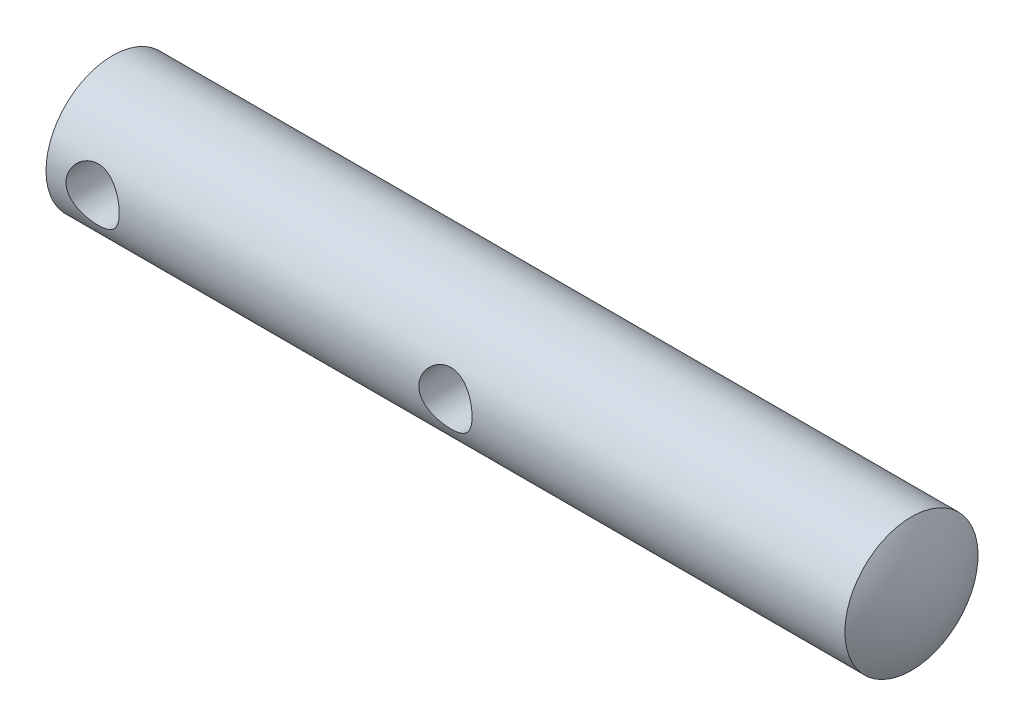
ISO-10303-21;
HEADER;
FILE_DESCRIPTION(('STEP AP214'),'2;1');
FILE_NAME('part.step','',(''),(''),'','','');
FILE_SCHEMA(('AUTOMOTIVE_DESIGN { 1 0 10303 214 1 1 1 1 }'));
ENDSEC;
DATA;
#1=APPLICATION_CONTEXT('core data for automotive mechanical design processes');
#2=APPLICATION_PROTOCOL_DEFINITION('international standard','automotive_design',2000,#1);
#3=PRODUCT_CONTEXT('',#1,'mechanical');
#4=PRODUCT('Part','Part','',(#3));
#5=PRODUCT_RELATED_PRODUCT_CATEGORY('part','',(#4));
#6=PRODUCT_DEFINITION_FORMATION('','',#4);
#7=PRODUCT_DEFINITION_CONTEXT('part definition',#1,'design');
#8=PRODUCT_DEFINITION('design','',#6,#7);
#9=PRODUCT_DEFINITION_SHAPE('','',#8);
#10=(LENGTH_UNIT() NAMED_UNIT(*) SI_UNIT(.MILLI.,.METRE.));
#11=(NAMED_UNIT(*) PLANE_ANGLE_UNIT() SI_UNIT($,.RADIAN.));
#12=(NAMED_UNIT(*) SI_UNIT($,.STERADIAN.) SOLID_ANGLE_UNIT());
#13=UNCERTAINTY_MEASURE_WITH_UNIT(LENGTH_MEASURE(1.E-05),#10,'distance_accuracy_value','');
#14=(GEOMETRIC_REPRESENTATION_CONTEXT(3) GLOBAL_UNCERTAINTY_ASSIGNED_CONTEXT((#13)) GLOBAL_UNIT_ASSIGNED_CONTEXT((#10,
#11,#12)) REPRESENTATION_CONTEXT('',''));
#15=CARTESIAN_POINT('',(0.,0.,0.));
#16=DIRECTION('',(0.,0.,1.));
#17=DIRECTION('',(1.,0.,0.));
#18=AXIS2_PLACEMENT_3D('',#15,#16,#17);
#19=CARTESIAN_POINT('',(4.86154146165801,0.,5.));
#20=DIRECTION('',(0.,0.,1.));
#21=DIRECTION('',(1.,0.,0.));
#22=AXIS2_PLACEMENT_3D('',#19,#20,#21);
#23=CYLINDRICAL_SURFACE('',#22,2.);
#24=CARTESIAN_POINT('',(6.861541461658,0.,5.));
#25=CARTESIAN_POINT('',(6.86153160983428,0.10749300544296,4.99999271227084));
#26=CARTESIAN_POINT('',(6.85282370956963,0.215172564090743,4.99649294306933));
#27=CARTESIAN_POINT('',(6.81829375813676,0.427496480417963,4.98283453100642));
#28=CARTESIAN_POINT('',(6.79242518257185,0.532131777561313,4.97265778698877));
#29=CARTESIAN_POINT('',(6.72466538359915,0.734953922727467,4.94674209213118));
#30=CARTESIAN_POINT('',(6.68282661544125,0.833160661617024,4.93102136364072));
#31=CARTESIAN_POINT('',(6.58452228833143,1.02107197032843,4.89556610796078));
#32=CARTESIAN_POINT('',(6.52806180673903,1.11077947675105,4.87583297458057));
#33=CARTESIAN_POINT('',(6.39930596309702,1.28350100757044,4.83330886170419));
#34=CARTESIAN_POINT('',(6.3264348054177,1.36606227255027,4.81042296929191));
#35=CARTESIAN_POINT('',(6.16814145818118,1.51817500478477,4.76460576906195));
#36=CARTESIAN_POINT('',(6.0827131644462,1.58772010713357,4.74167444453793));
#37=CARTESIAN_POINT('',(5.89711339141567,1.71487456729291,4.69722791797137));
#38=CARTESIAN_POINT('',(5.79645497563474,1.77181498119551,4.67582115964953));
#39=CARTESIAN_POINT('',(5.5860050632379,1.86775471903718,4.63833647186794));
#40=CARTESIAN_POINT('',(5.47621793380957,1.90676256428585,4.62225601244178));
#41=CARTESIAN_POINT('',(5.25582912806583,1.96389882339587,4.59826357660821));
#42=CARTESIAN_POINT('',(5.14549022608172,1.98289396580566,4.59001420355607));
#43=CARTESIAN_POINT('',(4.92290646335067,2.00217296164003,4.58164004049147));
#44=CARTESIAN_POINT('',(4.81066256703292,2.00246601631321,4.58151125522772));
#45=CARTESIAN_POINT('',(4.5957847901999,1.98498936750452,4.58910500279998));
#46=CARTESIAN_POINT('',(4.49302574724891,1.96847531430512,4.59628175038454));
#47=CARTESIAN_POINT('',(4.29188190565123,1.9199468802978,4.6167618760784));
#48=CARTESIAN_POINT('',(4.19349787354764,1.8879297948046,4.63006632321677));
#49=CARTESIAN_POINT('',(4.00152362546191,1.80869473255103,4.66159485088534));
#50=CARTESIAN_POINT('',(3.90807222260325,1.76117986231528,4.67991379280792));
#51=CARTESIAN_POINT('',(3.73012564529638,1.65250646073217,4.71938116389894));
#52=CARTESIAN_POINT('',(3.64563385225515,1.59134280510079,4.74053065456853));
#53=CARTESIAN_POINT('',(3.48113173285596,1.45155059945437,4.78526736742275));
#54=CARTESIAN_POINT('',(3.40197273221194,1.37193746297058,4.80891664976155));
#55=CARTESIAN_POINT('',(3.25785698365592,1.20031442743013,4.85459824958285));
#56=CARTESIAN_POINT('',(3.19290306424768,1.10830206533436,4.87663024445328));
#57=CARTESIAN_POINT('',(3.07792401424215,0.912077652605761,4.91714681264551));
#58=CARTESIAN_POINT('',(3.02821918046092,0.8076604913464,4.93555270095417));
#59=CARTESIAN_POINT('',(2.94737360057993,0.591023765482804,4.96614828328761));
#60=CARTESIAN_POINT('',(2.91622342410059,0.478808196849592,4.97834113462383));
#61=CARTESIAN_POINT('',(2.87509316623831,0.256895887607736,4.99456139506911));
#62=CARTESIAN_POINT('',(2.86396900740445,0.147443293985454,4.99902945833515));
#63=CARTESIAN_POINT('',(2.8598283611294,-0.0718453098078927,5.00068478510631));
#64=CARTESIAN_POINT('',(2.86680718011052,-0.181681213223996,4.9978739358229));
#65=CARTESIAN_POINT('',(2.89783321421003,-0.393432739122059,4.98557567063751));
#66=CARTESIAN_POINT('',(2.921099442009,-0.495482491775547,4.97639391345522));
#67=CARTESIAN_POINT('',(2.98297716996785,-0.694135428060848,4.95259441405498));
#68=CARTESIAN_POINT('',(3.02159064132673,-0.790737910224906,4.93797597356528));
#69=CARTESIAN_POINT('',(3.11432640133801,-0.979078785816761,4.90416594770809));
#70=CARTESIAN_POINT('',(3.1688869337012,-1.07057802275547,4.88484815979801));
#71=CARTESIAN_POINT('',(3.2914817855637,-1.24344359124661,4.84373364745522));
#72=CARTESIAN_POINT('',(3.35952150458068,-1.32480584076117,4.82193593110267));
#73=CARTESIAN_POINT('',(3.5124114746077,-1.48072304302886,4.77645117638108));
#74=CARTESIAN_POINT('',(3.59807500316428,-1.55447393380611,4.75273441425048));
#75=CARTESIAN_POINT('',(3.78098154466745,-1.68675119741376,4.70741672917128));
#76=CARTESIAN_POINT('',(3.87822646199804,-1.74527506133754,4.68581615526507));
#77=CARTESIAN_POINT('',(4.0830031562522,-1.84580750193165,4.64714299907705));
#78=CARTESIAN_POINT('',(4.1906254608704,-1.88765059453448,4.63011630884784));
#79=CARTESIAN_POINT('',(4.41227511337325,-1.95229621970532,4.60323673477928));
#80=CARTESIAN_POINT('',(4.52629766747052,-1.97511280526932,4.59337855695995));
#81=CARTESIAN_POINT('',(4.74866936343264,-1.9997156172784,4.58271759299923));
#82=CARTESIAN_POINT('',(4.85683630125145,-2.00289708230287,4.58131421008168));
#83=CARTESIAN_POINT('',(5.07208631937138,-1.99180315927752,4.58614836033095));
#84=CARTESIAN_POINT('',(5.17916953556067,-1.97752998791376,4.59238492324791));
#85=CARTESIAN_POINT('',(5.38487365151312,-1.93307136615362,4.61126649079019));
#86=CARTESIAN_POINT('',(5.48366173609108,-1.90353749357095,4.62364831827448));
#87=CARTESIAN_POINT('',(5.67492009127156,-1.83000544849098,4.65324001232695));
#88=CARTESIAN_POINT('',(5.7673886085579,-1.78600328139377,4.67045121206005));
#89=CARTESIAN_POINT('',(5.94915108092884,-1.68187276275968,4.7089860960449));
#90=CARTESIAN_POINT('',(6.03796013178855,-1.62096533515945,4.73048882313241));
#91=CARTESIAN_POINT('',(6.20453477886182,-1.48589211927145,4.77463804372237));
#92=CARTESIAN_POINT('',(6.28229703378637,-1.41172233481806,4.79728488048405));
#93=CARTESIAN_POINT('',(6.42974431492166,-1.2465055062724,4.84293567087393));
#94=CARTESIAN_POINT('',(6.49857876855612,-1.15467600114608,4.86586757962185));
#95=CARTESIAN_POINT('',(6.61987850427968,-0.959900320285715,4.90800406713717));
#96=CARTESIAN_POINT('',(6.67233617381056,-0.856949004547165,4.92720691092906));
#97=CARTESIAN_POINT('',(6.75816367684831,-0.644738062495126,4.95939714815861));
#98=CARTESIAN_POINT('',(6.79187078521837,-0.535631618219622,4.97249363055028));
#99=CARTESIAN_POINT('',(6.84018058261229,-0.312876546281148,4.99144306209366));
#100=CARTESIAN_POINT('',(6.8548438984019,-0.199243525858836,4.99731899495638));
#101=CARTESIAN_POINT('',(6.86093684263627,-0.0569122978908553,4.99975899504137));
#102=CARTESIAN_POINT('',(6.8615440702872,-0.0284626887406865,5.00000192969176));
#103=CARTESIAN_POINT('',(6.861541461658,0.,5.));
#104=B_SPLINE_CURVE_WITH_KNOTS('',3,(#24,#25,#26,#27,#28,#29,#30,#31,#32,#33,#34,#35,#36,#37,
#38,#39,#40,#41,#42,#43,#44,#45,#46,#47,#48,#49,#50,#51,#52,#53,#54,#55,#56,#57,#58,#59,#60,#61,
#62,#63,#64,#65,#66,#67,#68,#69,#70,#71,#72,#73,#74,#75,#76,#77,#78,#79,#80,#81,#82,#83,#84,#85,
#86,#87,#88,#89,#90,#91,#92,#93,#94,#95,#96,#97,#98,#99,#100,#101,#102,#103),.UNSPECIFIED.,.T.,
.F.,(4,2,2,2,2,2,2,2,2,2,2,2,2,2,2,2,2,2,2,2,2,2,2,2,2,2,2,2,2,2,2,2,2,2,2,2,2,2,2,4),(0.,
0.32240298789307,0.645683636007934,0.96791145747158,1.29002753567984,1.62597381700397,
1.96208394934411,2.31315258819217,2.66405423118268,2.99904105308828,3.33386306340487,
3.64538328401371,3.95695787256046,4.27489126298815,4.59294421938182,4.93558349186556,
5.27829092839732,5.62776913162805,5.97706956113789,6.30569184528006,6.6342289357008,
6.94800455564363,7.26182048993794,7.5852351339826,7.90877959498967,8.25368474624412,
8.59864669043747,8.94695045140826,9.29499672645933,9.61799673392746,9.94095572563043,
10.2511431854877,10.5614163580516,10.8894546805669,11.2175920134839,11.5670042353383,
11.9165786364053,12.2596430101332,12.6016125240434,12.6869804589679),.UNSPECIFIED.);
#105=CARTESIAN_POINT('',(6.861541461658,0.,5.));
#106=VERTEX_POINT('',#105);
#107=EDGE_CURVE('E32',#106,#106,#104,.T.);
#108=ORIENTED_EDGE('',*,*,#107,.T.);
#109=EDGE_LOOP('',(#108));
#110=FACE_BOUND('',#109,.T.);
#111=CARTESIAN_POINT('',(4.86154146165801,0.,0.));
#112=DIRECTION('',(0.,0.,-1.));
#113=DIRECTION('',(0.,1.,0.));
#114=AXIS2_PLACEMENT_3D('',#111,#112,#113);
#115=CIRCLE('',#114,2.);
#116=CARTESIAN_POINT('',(4.86154146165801,2.,0.));
#117=VERTEX_POINT('',#116);
#118=EDGE_CURVE('E8',#117,#117,#115,.F.);
#119=ORIENTED_EDGE('',*,*,#118,.F.);
#120=EDGE_LOOP('',(#119));
#121=FACE_BOUND('',#120,.T.);
#122=ADVANCED_FACE('F12',(#110,#121),#23,.F.);
#123=CARTESIAN_POINT('',(31.361541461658,0.,5.));
#124=DIRECTION('',(0.,0.,1.));
#125=DIRECTION('',(1.,0.,0.));
#126=AXIS2_PLACEMENT_3D('',#123,#124,#125);
#127=CYLINDRICAL_SURFACE('',#126,2.);
#128=CARTESIAN_POINT('',(33.361541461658,0.,5.));
#129=CARTESIAN_POINT('',(33.3615316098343,0.107493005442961,4.99999271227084));
#130=CARTESIAN_POINT('',(33.3528237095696,0.215172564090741,4.99649294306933));
#131=CARTESIAN_POINT('',(33.3182937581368,0.427496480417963,4.98283453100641));
#132=CARTESIAN_POINT('',(33.2924251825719,0.532131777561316,4.97265778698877));
#133=CARTESIAN_POINT('',(33.2246653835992,0.734953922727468,4.94674209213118));
#134=CARTESIAN_POINT('',(33.1828266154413,0.833160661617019,4.93102136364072));
#135=CARTESIAN_POINT('',(33.0845222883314,1.02107197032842,4.89556610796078));
#136=CARTESIAN_POINT('',(33.0280618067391,1.11077947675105,4.87583297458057));
#137=CARTESIAN_POINT('',(32.899305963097,1.28350100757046,4.83330886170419));
#138=CARTESIAN_POINT('',(32.8264348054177,1.36606227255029,4.81042296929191));
#139=CARTESIAN_POINT('',(32.6681414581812,1.51817500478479,4.76460576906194));
#140=CARTESIAN_POINT('',(32.5827131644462,1.58772010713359,4.74167444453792));
#141=CARTESIAN_POINT('',(32.3971133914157,1.71487456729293,4.69722791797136));
#142=CARTESIAN_POINT('',(32.2964549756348,1.77181498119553,4.67582115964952));
#143=CARTESIAN_POINT('',(32.086005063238,1.86775471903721,4.63833647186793));
#144=CARTESIAN_POINT('',(31.9762179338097,1.90676256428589,4.62225601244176));
#145=CARTESIAN_POINT('',(31.7558291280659,1.96389882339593,4.59826357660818));
#146=CARTESIAN_POINT('',(31.6454902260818,1.98289396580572,4.59001420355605));
#147=CARTESIAN_POINT('',(31.4229064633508,2.00217296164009,4.58164004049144));
#148=CARTESIAN_POINT('',(31.310662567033,2.00246601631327,4.58151125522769));
#149=CARTESIAN_POINT('',(31.0957847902,1.9849893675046,4.58910500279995));
#150=CARTESIAN_POINT('',(30.993025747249,1.96847531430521,4.5962817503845));
#151=CARTESIAN_POINT('',(30.7918819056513,1.91994688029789,4.61676187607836));
#152=CARTESIAN_POINT('',(30.6934978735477,1.88792979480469,4.63006632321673));
#153=CARTESIAN_POINT('',(30.501523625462,1.80869473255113,4.6615948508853));
#154=CARTESIAN_POINT('',(30.4080722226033,1.76117986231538,4.67991379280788));
#155=CARTESIAN_POINT('',(30.2301256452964,1.65250646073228,4.7193811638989));
#156=CARTESIAN_POINT('',(30.1456338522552,1.5913428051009,4.74053065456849));
#157=CARTESIAN_POINT('',(29.981131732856,1.4515505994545,4.78526736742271));
#158=CARTESIAN_POINT('',(29.901972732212,1.37193746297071,4.80891664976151));
#159=CARTESIAN_POINT('',(29.757856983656,1.20031442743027,4.85459824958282));
#160=CARTESIAN_POINT('',(29.6929030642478,1.10830206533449,4.87663024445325));
#161=CARTESIAN_POINT('',(29.5779240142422,0.912077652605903,4.91714681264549));
#162=CARTESIAN_POINT('',(29.528219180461,0.807660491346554,4.93555270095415));
#163=CARTESIAN_POINT('',(29.4473736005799,0.591023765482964,4.96614828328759));
#164=CARTESIAN_POINT('',(29.4162234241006,0.478808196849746,4.97834113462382));
#165=CARTESIAN_POINT('',(29.3750931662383,0.256895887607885,4.9945613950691));
#166=CARTESIAN_POINT('',(29.3639690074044,0.147443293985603,4.99902945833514));
#167=CARTESIAN_POINT('',(29.3598283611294,-0.0718453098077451,5.00068478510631));
#168=CARTESIAN_POINT('',(29.3668071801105,-0.181681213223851,4.99787393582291));
#169=CARTESIAN_POINT('',(29.39783321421,-0.39343273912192,4.98557567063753));
#170=CARTESIAN_POINT('',(29.421099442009,-0.495482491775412,4.97639391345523));
#171=CARTESIAN_POINT('',(29.4829771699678,-0.694135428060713,4.952594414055));
#172=CARTESIAN_POINT('',(29.5215906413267,-0.790737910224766,4.93797597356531));
#173=CARTESIAN_POINT('',(29.614326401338,-0.97907878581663,4.90416594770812));
#174=CARTESIAN_POINT('',(29.6688869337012,-1.07057802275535,4.88484815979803));
#175=CARTESIAN_POINT('',(29.7914817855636,-1.2434435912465,4.84373364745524));
#176=CARTESIAN_POINT('',(29.8595215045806,-1.32480584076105,4.82193593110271));
#177=CARTESIAN_POINT('',(30.0124114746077,-1.48072304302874,4.77645117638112));
#178=CARTESIAN_POINT('',(30.0980750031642,-1.55447393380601,4.75273441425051));
#179=CARTESIAN_POINT('',(30.2809815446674,-1.68675119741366,4.70741672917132));
#180=CARTESIAN_POINT('',(30.378226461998,-1.74527506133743,4.68581615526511));
#181=CARTESIAN_POINT('',(30.5830031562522,-1.84580750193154,4.64714299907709));
#182=CARTESIAN_POINT('',(30.6906254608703,-1.88765059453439,4.63011630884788));
#183=CARTESIAN_POINT('',(30.9122751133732,-1.95229621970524,4.60323673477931));
#184=CARTESIAN_POINT('',(31.0262976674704,-1.97511280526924,4.59337855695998));
#185=CARTESIAN_POINT('',(31.2486693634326,-1.99971561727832,4.58271759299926));
#186=CARTESIAN_POINT('',(31.3568363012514,-2.0028970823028,4.58131421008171));
#187=CARTESIAN_POINT('',(31.5720863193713,-1.99180315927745,4.58614836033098));
#188=CARTESIAN_POINT('',(31.6791695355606,-1.9775299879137,4.59238492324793));
#189=CARTESIAN_POINT('',(31.8848736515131,-1.93307136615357,4.61126649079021));
#190=CARTESIAN_POINT('',(31.983661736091,-1.9035374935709,4.62364831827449));
#191=CARTESIAN_POINT('',(32.1749200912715,-1.83000544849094,4.65324001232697));
#192=CARTESIAN_POINT('',(32.2673886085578,-1.78600328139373,4.67045121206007));
#193=CARTESIAN_POINT('',(32.4491510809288,-1.68187276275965,4.70898609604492));
#194=CARTESIAN_POINT('',(32.5379601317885,-1.62096533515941,4.73048882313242));
#195=CARTESIAN_POINT('',(32.7045347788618,-1.48589211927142,4.77463804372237));
#196=CARTESIAN_POINT('',(32.7822970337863,-1.41172233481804,4.79728488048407));
#197=CARTESIAN_POINT('',(32.9297443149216,-1.24650550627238,4.84293567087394));
#198=CARTESIAN_POINT('',(32.9985787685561,-1.15467600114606,4.86586757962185));
#199=CARTESIAN_POINT('',(33.1198785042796,-0.959900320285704,4.90800406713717));
#200=CARTESIAN_POINT('',(33.1723361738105,-0.85694900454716,4.92720691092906));
#201=CARTESIAN_POINT('',(33.2581636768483,-0.644738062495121,4.95939714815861));
#202=CARTESIAN_POINT('',(33.2918707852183,-0.535631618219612,4.97249363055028));
#203=CARTESIAN_POINT('',(33.3401805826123,-0.312876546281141,4.99144306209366));
#204=CARTESIAN_POINT('',(33.3548438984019,-0.199243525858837,4.99731899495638));
#205=CARTESIAN_POINT('',(33.3609368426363,-0.0569122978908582,4.99975899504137));
#206=CARTESIAN_POINT('',(33.3615440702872,-0.0284626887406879,5.00000192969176));
#207=CARTESIAN_POINT('',(33.361541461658,0.,5.));
#208=B_SPLINE_CURVE_WITH_KNOTS('',3,(#128,#129,#130,#131,#132,#133,#134,#135,#136,#137,#138,
#139,#140,#141,#142,#143,#144,#145,#146,#147,#148,#149,#150,#151,#152,#153,#154,#155,#156,#157,
#158,#159,#160,#161,#162,#163,#164,#165,#166,#167,#168,#169,#170,#171,#172,#173,#174,#175,#176,
#177,#178,#179,#180,#181,#182,#183,#184,#185,#186,#187,#188,#189,#190,#191,#192,#193,#194,#195,
#196,#197,#198,#199,#200,#201,#202,#203,#204,#205,#206,#207),.UNSPECIFIED.,.T.,.F.,(4,2,2,2,2,2,
2,2,2,2,2,2,2,2,2,2,2,2,2,2,2,2,2,2,2,2,2,2,2,2,2,2,2,2,2,2,2,2,2,4),(0.,0.322402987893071,
0.645683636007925,0.967911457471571,1.29002753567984,1.62597381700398,1.96208394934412,
2.31315258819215,2.66405423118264,2.99904105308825,3.33386306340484,3.6453832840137,
3.95695787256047,4.27489126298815,4.59294421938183,4.93558349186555,5.2782909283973,
5.62776913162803,5.97706956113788,6.30569184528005,6.6342289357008,6.94800455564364,
7.26182048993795,7.58523513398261,7.90877959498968,8.25368474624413,8.59864669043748,
8.94695045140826,9.29499672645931,9.61799673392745,9.94095572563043,10.2511431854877,
10.5614163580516,10.8894546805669,11.2175920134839,11.5670042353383,11.9165786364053,
12.2596430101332,12.6016125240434,12.6869804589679),.UNSPECIFIED.);
#209=CARTESIAN_POINT('',(33.361541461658,0.,5.));
#210=VERTEX_POINT('',#209);
#211=EDGE_CURVE('E24',#210,#210,#208,.T.);
#212=ORIENTED_EDGE('',*,*,#211,.T.);
#213=EDGE_LOOP('',(#212));
#214=FACE_BOUND('',#213,.T.);
#215=CARTESIAN_POINT('',(31.361541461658,0.,0.));
#216=DIRECTION('',(0.,0.,-1.));
#217=DIRECTION('',(0.,1.,0.));
#218=AXIS2_PLACEMENT_3D('',#215,#216,#217);
#219=CIRCLE('',#218,2.);
#220=CARTESIAN_POINT('',(31.361541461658,2.00000000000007,0.));
#221=VERTEX_POINT('',#220);
#222=EDGE_CURVE('E16',#221,#221,#219,.F.);
#223=ORIENTED_EDGE('',*,*,#222,.F.);
#224=EDGE_LOOP('',(#223));
#225=FACE_BOUND('',#224,.T.);
#226=ADVANCED_FACE('F47',(#214,#225),#127,.F.);
#227=CARTESIAN_POINT('',(52.861541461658,0.,0.));
#228=DIRECTION('',(-1.,0.,0.));
#229=DIRECTION('',(0.,-1.,0.));
#230=AXIS2_PLACEMENT_3D('',#227,#228,#229);
#231=SPHERICAL_SURFACE('',#230,9.86154146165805);
#232=CARTESIAN_POINT('',(61.361541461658,0.,0.));
#233=DIRECTION('',(-1.,0.,0.));
#234=DIRECTION('',(0.,0.,1.));
#235=AXIS2_PLACEMENT_3D('',#232,#233,#234);
#236=CIRCLE('',#235,5.);
#237=CARTESIAN_POINT('',(61.361541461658,0.,5.));
#238=VERTEX_POINT('',#237);
#239=EDGE_CURVE('E29',#238,#238,#236,.T.);
#240=ORIENTED_EDGE('',*,*,#239,.F.);
#241=EDGE_LOOP('',(#240));
#242=FACE_BOUND('',#241,.T.);
#243=ADVANCED_FACE('F14',(#242),#231,.T.);
#244=CARTESIAN_POINT('',(1.36154146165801,0.,0.));
#245=DIRECTION('',(-1.,0.,0.));
#246=DIRECTION('',(0.,0.,1.));
#247=AXIS2_PLACEMENT_3D('',#244,#245,#246);
#248=CYLINDRICAL_SURFACE('',#247,5.);
#249=CARTESIAN_POINT('',(1.36154146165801,0.,0.));
#250=DIRECTION('',(-1.,0.,0.));
#251=DIRECTION('',(0.,0.,1.));
#252=AXIS2_PLACEMENT_3D('',#249,#250,#251);
#253=CIRCLE('',#252,5.);
#254=CARTESIAN_POINT('',(1.36154146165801,0.,5.));
#255=VERTEX_POINT('',#254);
#256=EDGE_CURVE('E26',#255,#255,#253,.T.);
#257=ORIENTED_EDGE('',*,*,#256,.F.);
#258=EDGE_LOOP('',(#257));
#259=FACE_BOUND('',#258,.T.);
#260=ORIENTED_EDGE('',*,*,#211,.F.);
#261=EDGE_LOOP('',(#260));
#262=FACE_BOUND('',#261,.T.);
#263=ORIENTED_EDGE('',*,*,#107,.F.);
#264=EDGE_LOOP('',(#263));
#265=FACE_BOUND('',#264,.T.);
#266=ORIENTED_EDGE('',*,*,#239,.T.);
#267=EDGE_LOOP('',(#266));
#268=FACE_BOUND('',#267,.T.);
#269=ADVANCED_FACE('F42',(#259,#262,#265,#268),#248,.T.);
#270=CARTESIAN_POINT('',(9.86154146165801,0.,0.));
#271=DIRECTION('',(-1.,0.,0.));
#272=DIRECTION('',(0.,1.,0.));
#273=AXIS2_PLACEMENT_3D('',#270,#271,#272);
#274=SPHERICAL_SURFACE('',#273,9.86154146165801);
#275=ORIENTED_EDGE('',*,*,#256,.T.);
#276=EDGE_LOOP('',(#275));
#277=FACE_BOUND('',#276,.T.);
#278=ADVANCED_FACE('F51',(#277),#274,.T.);
#279=CARTESIAN_POINT('',(37.361541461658,4.99999999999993,0.));
#280=DIRECTION('',(0.,0.,-1.));
#281=DIRECTION('',(0.,1.,0.));
#282=AXIS2_PLACEMENT_3D('',#279,#280,#281);
#283=PLANE('',#282);
#284=ORIENTED_EDGE('',*,*,#222,.T.);
#285=EDGE_LOOP('',(#284));
#286=FACE_BOUND('',#285,.T.);
#287=ADVANCED_FACE('F53',(#286),#283,.F.);
#288=ORIENTED_EDGE('',*,*,#118,.T.);
#289=EDGE_LOOP('',(#288));
#290=FACE_BOUND('',#289,.T.);
#291=ADVANCED_FACE('F61',(#290),#283,.F.);
#292=CLOSED_SHELL('',(#122,#226,#243,#269,#278,#287,#291));
#293=MANIFOLD_SOLID_BREP('B1',#292);
#294=ADVANCED_BREP_SHAPE_REPRESENTATION('',(#18,#293),#14);
#295=SHAPE_DEFINITION_REPRESENTATION(#9,#294);
ENDSEC;
END-ISO-10303-21;
